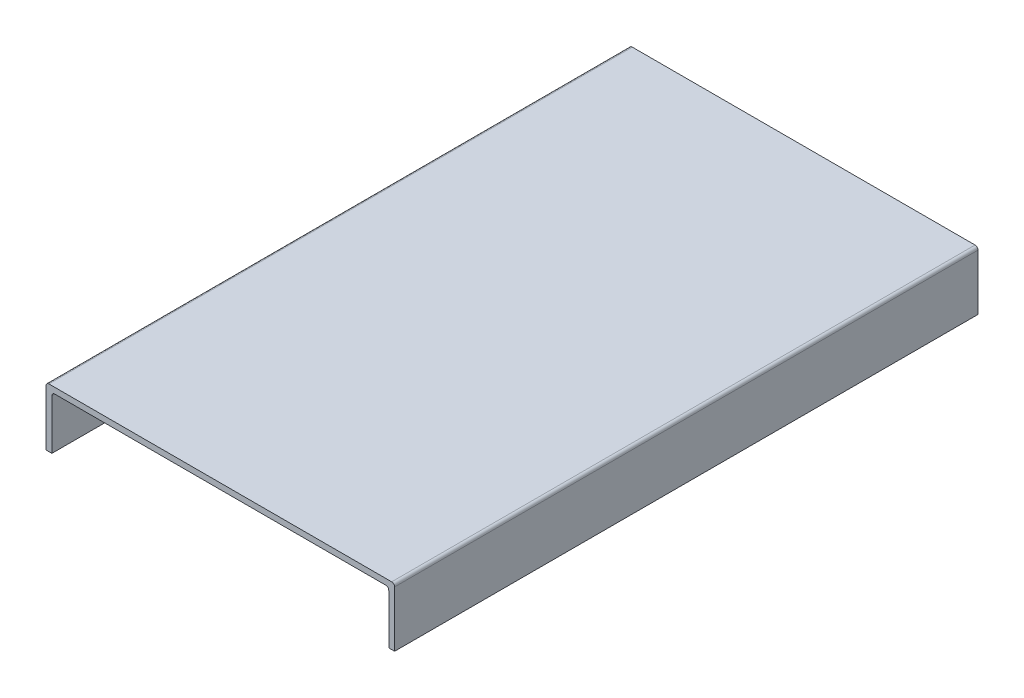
from build123d import *

# Parameters (mm, degrees)
EXTRU_MINCE1_DEPTH = 497
CONG_1_R           = 2.5
CONG_2_R           = 2.5
CONG_3_R           = 2.5
CONG_4_R           = 2.5


with BuildPart() as part:
    # Esquisse1 → Extru.-Mince1 (new body)
    with BuildSketch(Plane.XY):
        Polygon((0, 0), (0, 50), (297, 50), (297, 0), (292, 0), (292, 45), (5, 45), (5, 0), align=None)
    extrude(amount=EXTRU_MINCE1_DEPTH)

    # Cong_1
    cong_1_edges = [part.edges().sort_by_distance(p)[0] for p in [
        (297, 50, 248.5),
    ]]
    fillet(cong_1_edges, radius=CONG_1_R)

    # Cong_2
    cong_2_edges = [part.edges().sort_by_distance(p)[0] for p in [
        (0, 50, 248.5),
    ]]
    fillet(cong_2_edges, radius=CONG_2_R)

    # Cong_3
    cong_3_edges = [part.edges().sort_by_distance(p)[0] for p in [
        (292, 45, 248.5),
    ]]
    fillet(cong_3_edges, radius=CONG_3_R)

    # Cong_4
    cong_4_edges = [part.edges().sort_by_distance(p)[0] for p in [
        (5, 45, 248.5),
    ]]
    fillet(cong_4_edges, radius=CONG_4_R)


solid = part.part
